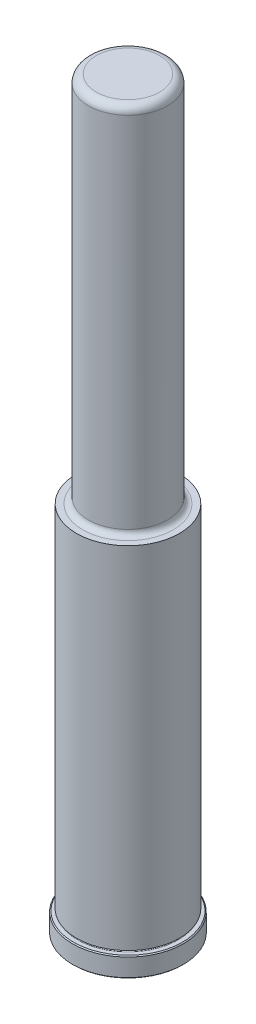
from build123d import *

# Parameters (mm, degrees)
CHAMFER1_SIZE = 0.381
FILLET1_R     = 3.175


with BuildPart() as part:
    # Sketch1 → Revolve1 (revolve)
    with BuildSketch(Plane(origin=(0, 0, 0), x_dir=(0, 0, -1), z_dir=(1, 0, 0)), mode=Mode.PRIVATE) as revolve1_sk:
        with BuildLine():
            Line((0, 0), (22.225, 0))
            Line((22.225, 0), (22.225, 7.9248))
            Line((22.225, 7.9248), (20.2438, 7.9248))
            ThreePointArc((20.2438, 7.9248), (19.8628, 8.3058), (20.2438, 8.6868))
            Line((20.2438, 8.6868), (20.6502, 8.6868))
            Line((20.6502, 8.6868), (20.6502, 149.225))
            Line((20.6502, 149.225), (18.1483, 149.225))
            ThreePointArc((18.1483, 149.225), (16.531853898, 149.894553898), (15.8623, 151.511))
            Line((15.8623, 151.511), (15.8623, 298.45))
            Line((15.8623, 298.45), (0, 298.45))
            Line((0, 298.45), (0, 0))
        make_face()
    revolve(revolve1_sk.sketch.rotate(Axis((0, 0, 0), (0, -1, 0)), 180), axis=Axis((0, 0, 0), (0, -1, 0)))

    # Chamfer1
    chamfer1_edges = [part.edges().sort_by_distance(p)[0] for p in [
        (0, 7.9248, -22.225),
        (0, 0, -22.225),
    ]]
    chamfer(chamfer1_edges, length=CHAMFER1_SIZE)

    # Fillet1
    fillet1_edges = [part.edges().sort_by_distance(p)[0] for p in [
        (0, 298.45, -15.8623),
    ]]
    fillet(fillet1_edges, radius=FILLET1_R)


solid = part.part
